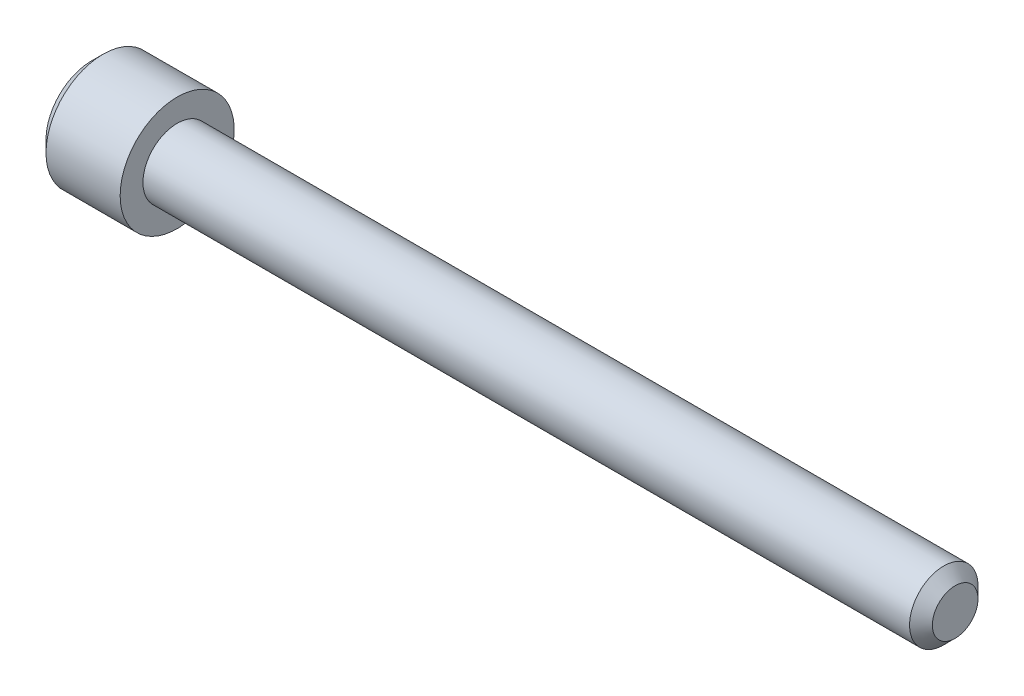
ISO-10303-21;
HEADER;
FILE_DESCRIPTION(('STEP AP214'),'2;1');
FILE_NAME('part.step','',(''),(''),'','','');
FILE_SCHEMA(('AUTOMOTIVE_DESIGN { 1 0 10303 214 1 1 1 1 }'));
ENDSEC;
DATA;
#1=APPLICATION_CONTEXT('core data for automotive mechanical design processes');
#2=APPLICATION_PROTOCOL_DEFINITION('international standard','automotive_design',2000,#1);
#3=PRODUCT_CONTEXT('',#1,'mechanical');
#4=PRODUCT('Part','Part','',(#3));
#5=PRODUCT_RELATED_PRODUCT_CATEGORY('part','',(#4));
#6=PRODUCT_DEFINITION_FORMATION('','',#4);
#7=PRODUCT_DEFINITION_CONTEXT('part definition',#1,'design');
#8=PRODUCT_DEFINITION('design','',#6,#7);
#9=PRODUCT_DEFINITION_SHAPE('','',#8);
#10=(LENGTH_UNIT() NAMED_UNIT(*) SI_UNIT(.MILLI.,.METRE.));
#11=(NAMED_UNIT(*) PLANE_ANGLE_UNIT() SI_UNIT($,.RADIAN.));
#12=(NAMED_UNIT(*) SI_UNIT($,.STERADIAN.) SOLID_ANGLE_UNIT());
#13=UNCERTAINTY_MEASURE_WITH_UNIT(LENGTH_MEASURE(1.E-05),#10,'distance_accuracy_value','');
#14=(GEOMETRIC_REPRESENTATION_CONTEXT(3) GLOBAL_UNCERTAINTY_ASSIGNED_CONTEXT((#13)) GLOBAL_UNIT_ASSIGNED_CONTEXT((#10,
#11,#12)) REPRESENTATION_CONTEXT('',''));
#15=CARTESIAN_POINT('',(0.,0.,0.));
#16=DIRECTION('',(0.,0.,1.));
#17=DIRECTION('',(1.,0.,0.));
#18=AXIS2_PLACEMENT_3D('',#15,#16,#17);
#19=CARTESIAN_POINT('',(0.,0.,0.));
#20=DIRECTION('',(1.,0.,0.));
#21=DIRECTION('',(0.,0.,-1.));
#22=AXIS2_PLACEMENT_3D('',#19,#20,#21);
#23=PLANE('',#22);
#24=CARTESIAN_POINT('',(0.,0.,0.));
#25=DIRECTION('',(-1.,0.,0.));
#26=DIRECTION('',(0.,0.,1.));
#27=AXIS2_PLACEMENT_3D('',#24,#25,#26);
#28=CIRCLE('',#27,2.5);
#29=CARTESIAN_POINT('',(0.,0.,2.5));
#30=VERTEX_POINT('',#29);
#31=EDGE_CURVE('E53',#30,#30,#28,.T.);
#32=ORIENTED_EDGE('',*,*,#31,.T.);
#33=EDGE_LOOP('',(#32));
#34=FACE_BOUND('',#33,.T.);
#35=ADVANCED_FACE('F34',(#34),#23,.F.);
#36=CARTESIAN_POINT('',(-3.73940655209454,0.,0.));
#37=DIRECTION('',(-1.,0.,0.));
#38=DIRECTION('',(0.,0.,1.));
#39=AXIS2_PLACEMENT_3D('',#36,#37,#38);
#40=CYLINDRICAL_SURFACE('',#39,2.5);
#41=ORIENTED_EDGE('',*,*,#31,.F.);
#42=EDGE_LOOP('',(#41));
#43=FACE_BOUND('',#42,.T.);
#44=CARTESIAN_POINT('',(0.999999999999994,0.,0.));
#45=DIRECTION('',(-1.,0.,0.));
#46=DIRECTION('',(0.,0.,1.));
#47=AXIS2_PLACEMENT_3D('',#44,#45,#46);
#48=CIRCLE('',#47,2.5);
#49=CARTESIAN_POINT('',(0.999999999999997,0.,2.5));
#50=VERTEX_POINT('',#49);
#51=EDGE_CURVE('E56',#50,#50,#48,.T.);
#52=ORIENTED_EDGE('',*,*,#51,.T.);
#53=EDGE_LOOP('',(#52));
#54=FACE_BOUND('',#53,.T.);
#55=ADVANCED_FACE('F82',(#43,#54),#40,.T.);
#56=CARTESIAN_POINT('',(1.,2.49999999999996,0.));
#57=DIRECTION('',(1.,0.,0.));
#58=DIRECTION('',(0.,0.,-1.));
#59=AXIS2_PLACEMENT_3D('',#56,#57,#58);
#60=PLANE('',#59);
#61=CARTESIAN_POINT('',(0.999999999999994,0.,0.));
#62=DIRECTION('',(1.,0.,0.));
#63=DIRECTION('',(0.,0.,-1.));
#64=AXIS2_PLACEMENT_3D('',#61,#62,#63);
#65=CIRCLE('',#64,4.);
#66=CARTESIAN_POINT('',(0.999999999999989,0.,-4.));
#67=VERTEX_POINT('',#66);
#68=EDGE_CURVE('E48',#67,#67,#65,.F.);
#69=ORIENTED_EDGE('',*,*,#68,.T.);
#70=EDGE_LOOP('',(#69));
#71=FACE_BOUND('',#70,.T.);
#72=ORIENTED_EDGE('',*,*,#51,.F.);
#73=EDGE_LOOP('',(#72));
#74=FACE_BOUND('',#73,.T.);
#75=ADVANCED_FACE('F87',(#71,#74),#60,.F.);
#76=CARTESIAN_POINT('',(-3.73940655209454,0.,0.));
#77=DIRECTION('',(-1.,0.,0.));
#78=DIRECTION('',(0.,0.,1.));
#79=AXIS2_PLACEMENT_3D('',#76,#77,#78);
#80=CYLINDRICAL_SURFACE('',#79,5.);
#81=CARTESIAN_POINT('',(2.00000000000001,0.,0.));
#82=DIRECTION('',(1.,0.,0.));
#83=DIRECTION('',(0.,0.,-1.));
#84=AXIS2_PLACEMENT_3D('',#81,#82,#83);
#85=CIRCLE('',#84,5.);
#86=CARTESIAN_POINT('',(2.00000000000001,0.,-5.00000000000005));
#87=VERTEX_POINT('',#86);
#88=EDGE_CURVE('E44',#87,#87,#85,.T.);
#89=ORIENTED_EDGE('',*,*,#88,.T.);
#90=EDGE_LOOP('',(#89));
#91=FACE_BOUND('',#90,.T.);
#92=CARTESIAN_POINT('',(8.50000000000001,0.,0.));
#93=DIRECTION('',(-1.,0.,0.));
#94=DIRECTION('',(0.,0.,1.));
#95=AXIS2_PLACEMENT_3D('',#92,#93,#94);
#96=CIRCLE('',#95,5.);
#97=CARTESIAN_POINT('',(8.50000000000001,0.,4.99999999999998));
#98=VERTEX_POINT('',#97);
#99=EDGE_CURVE('E59',#98,#98,#96,.T.);
#100=ORIENTED_EDGE('',*,*,#99,.T.);
#101=EDGE_LOOP('',(#100));
#102=FACE_BOUND('',#101,.T.);
#103=ADVANCED_FACE('F78',(#91,#102),#80,.T.);
#104=CARTESIAN_POINT('',(8.50000000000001,5.00000000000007,0.));
#105=DIRECTION('',(-1.,0.,0.));
#106=DIRECTION('',(0.,0.,1.));
#107=AXIS2_PLACEMENT_3D('',#104,#105,#106);
#108=PLANE('',#107);
#109=ORIENTED_EDGE('',*,*,#99,.F.);
#110=EDGE_LOOP('',(#109));
#111=FACE_BOUND('',#110,.T.);
#112=CARTESIAN_POINT('',(8.50000000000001,0.,0.));
#113=DIRECTION('',(-1.,0.,0.));
#114=DIRECTION('',(0.,0.,1.));
#115=AXIS2_PLACEMENT_3D('',#112,#113,#114);
#116=CIRCLE('',#115,3.);
#117=CARTESIAN_POINT('',(8.50000000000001,0.,2.99999999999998));
#118=VERTEX_POINT('',#117);
#119=EDGE_CURVE('E62',#118,#118,#116,.T.);
#120=ORIENTED_EDGE('',*,*,#119,.T.);
#121=EDGE_LOOP('',(#120));
#122=FACE_BOUND('',#121,.T.);
#123=ADVANCED_FACE('F66',(#111,#122),#108,.F.);
#124=CARTESIAN_POINT('',(-3.73940655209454,0.,0.));
#125=DIRECTION('',(-1.,0.,0.));
#126=DIRECTION('',(0.,0.,1.));
#127=AXIS2_PLACEMENT_3D('',#124,#125,#126);
#128=CYLINDRICAL_SURFACE('',#127,3.);
#129=CARTESIAN_POINT('',(75.7,0.,0.));
#130=DIRECTION('',(-1.,0.,0.));
#131=DIRECTION('',(0.,0.,1.));
#132=AXIS2_PLACEMENT_3D('',#129,#130,#131);
#133=CIRCLE('',#132,3.);
#134=CARTESIAN_POINT('',(75.7,0.,3.0000000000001));
#135=VERTEX_POINT('',#134);
#136=EDGE_CURVE('E40',#135,#135,#133,.T.);
#137=ORIENTED_EDGE('',*,*,#136,.T.);
#138=EDGE_LOOP('',(#137));
#139=FACE_BOUND('',#138,.T.);
#140=ORIENTED_EDGE('',*,*,#119,.F.);
#141=EDGE_LOOP('',(#140));
#142=FACE_BOUND('',#141,.T.);
#143=ADVANCED_FACE('F68',(#139,#142),#128,.T.);
#144=CARTESIAN_POINT('',(76.7,3.00000000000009,0.));
#145=DIRECTION('',(-1.,0.,0.));
#146=DIRECTION('',(0.,0.,1.));
#147=AXIS2_PLACEMENT_3D('',#144,#145,#146);
#148=PLANE('',#147);
#149=CARTESIAN_POINT('',(76.7,0.,0.));
#150=DIRECTION('',(-1.,0.,0.));
#151=DIRECTION('',(0.,0.,1.));
#152=AXIS2_PLACEMENT_3D('',#149,#150,#151);
#153=CIRCLE('',#152,2.00000000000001);
#154=CARTESIAN_POINT('',(76.7,0.,2.0000000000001));
#155=VERTEX_POINT('',#154);
#156=EDGE_CURVE('E10',#155,#155,#153,.F.);
#157=ORIENTED_EDGE('',*,*,#156,.T.);
#158=EDGE_LOOP('',(#157));
#159=FACE_BOUND('',#158,.T.);
#160=ADVANCED_FACE('F70',(#159),#148,.F.);
#161=CARTESIAN_POINT('',(0.999999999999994,0.,0.));
#162=DIRECTION('',(1.,0.,0.));
#163=DIRECTION('',(0.,0.,-1.));
#164=AXIS2_PLACEMENT_3D('',#161,#162,#163);
#165=CONICAL_SURFACE('',#164,4.,0.785398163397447);
#166=ORIENTED_EDGE('',*,*,#88,.F.);
#167=EDGE_LOOP('',(#166));
#168=FACE_BOUND('',#167,.T.);
#169=ORIENTED_EDGE('',*,*,#68,.F.);
#170=EDGE_LOOP('',(#169));
#171=FACE_BOUND('',#170,.T.);
#172=ADVANCED_FACE('F76',(#168,#171),#165,.T.);
#173=CARTESIAN_POINT('',(75.7,0.,0.));
#174=DIRECTION('',(-1.,0.,0.));
#175=DIRECTION('',(0.,0.,1.));
#176=AXIS2_PLACEMENT_3D('',#173,#174,#175);
#177=CONICAL_SURFACE('',#176,3.,0.785398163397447);
#178=ORIENTED_EDGE('',*,*,#156,.F.);
#179=EDGE_LOOP('',(#178));
#180=FACE_BOUND('',#179,.T.);
#181=ORIENTED_EDGE('',*,*,#136,.F.);
#182=EDGE_LOOP('',(#181));
#183=FACE_BOUND('',#182,.T.);
#184=ADVANCED_FACE('F104',(#180,#183),#177,.T.);
#185=CLOSED_SHELL('',(#35,#55,#75,#103,#123,#143,#160,#172,#184));
#186=MANIFOLD_SOLID_BREP('B2',#185);
#187=ADVANCED_BREP_SHAPE_REPRESENTATION('',(#18,#186),#14);
#188=SHAPE_DEFINITION_REPRESENTATION(#9,#187);
ENDSEC;
END-ISO-10303-21;
